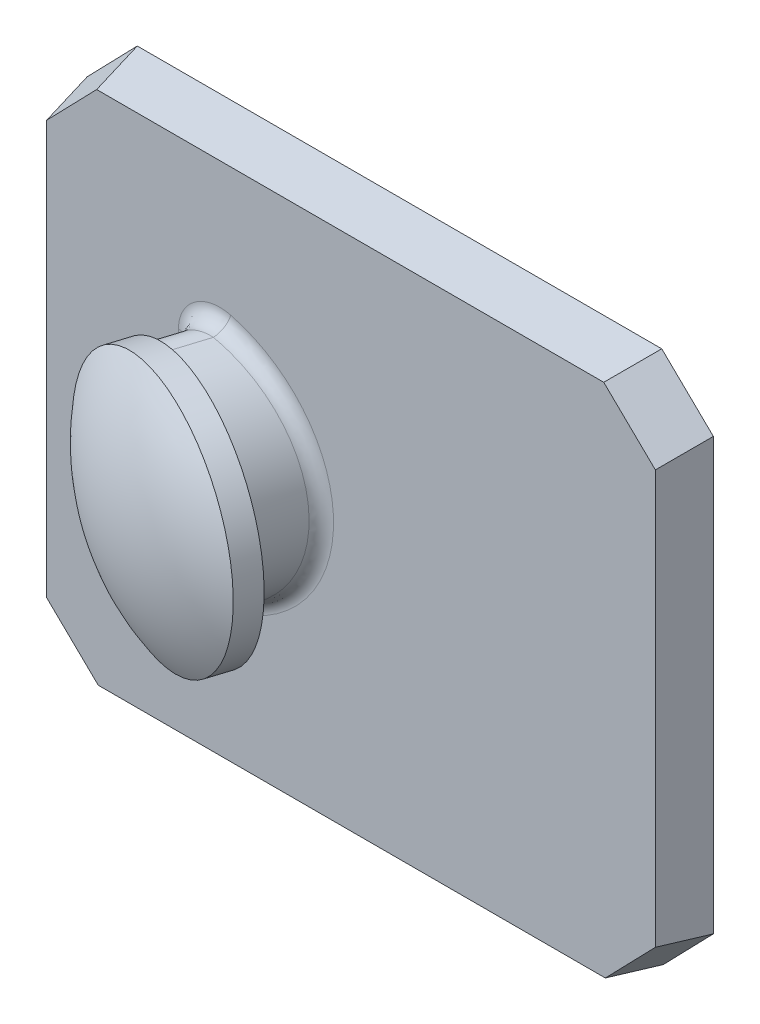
from build123d import *
from OCP.BRepFilletAPI import BRepFilletAPI_MakeChamfer

# Parameters (mm, degrees)
SKETCH1_W      = 12.699
SKETCH1_H      = 10.8
EXTRUDE1_DEPTH = 1
EXTRUDE1_TAPER = 10
EXTRUDE2_REACH = 105.423
FILLET2_R      = 0.3
CHAMFER1_SIZE  = 1
CHAMFER1_SIZE2 = 1.031574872


with BuildPart() as part:
    # Sketch1 → Extrude1 (new body)
    with BuildSketch(Plane.XY):
        with Locations((101.5505, 0)):
            Rectangle(SKETCH1_W, SKETCH1_H)
    extrude(amount=EXTRUDE1_DEPTH, taper=EXTRUDE1_TAPER)

    # Extrude2: up to this plane
    extrude2_end = Plane(origin=(95.201, -5.4, 1), z_dir=(0, 0, -1))
    # Sketch2 → Extrude2 (add, up to the surface)
    with BuildSketch(Plane(origin=(8.326251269, 0, -26.426922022), x_dir=(0.9537803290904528, 0, 0.30050471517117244), z_dir=(-0.30050471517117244, 0, 0.9537803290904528)), mode=Mode.PRIVATE) as extrude2_sk1:
        with BuildLine():
            Line((94.210058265, 1.848172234), (94.210058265, -1.81788696))
            ThreePointArc((94.210058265, -1.81788696), (94.406569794, -2.215246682), (94.841637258, -2.300263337))
            ThreePointArc((94.841637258, -2.300263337), (96.610057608, 0.015142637), (94.841637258, 2.330548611))
            ThreePointArc((94.841637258, 2.330548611), (94.406569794, 2.245531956), (94.210058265, 1.848172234))
        make_face()
    extrude2_tool1 = split(extrude(extrude2_sk1.sketch, amount=-EXTRUDE2_REACH, mode=Mode.PRIVATE), bisect_by=extrude2_end, keep=Keep.BOTH, mode=Mode.PRIVATE)
    add(extrude2_tool1.solids().sort_by_distance((99.168287, 0.015143, 2.194406))[0])

    # Sketch3 → Revolve2 (revolve)
    with BuildSketch(Plane(origin=(0, 0, 0), x_dir=(1, 0, 0), z_dir=(0, 1, 0)), mode=Mode.PRIVATE) as revolve2_sk:
        with BuildLine():
            Line((99.31173721, -2.157209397), (101.697584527, -2.908912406))
            Line((101.697584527, -2.908912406), (101.547430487, -3.385489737))
            ThreePointArc((101.547430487, -3.385489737), (100.238921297, -3.560859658), (98.935380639, -3.351736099))
            Line((98.935380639, -3.351736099), (99.31173721, -2.157209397))
        make_face()
    revolve(revolve2_sk.sketch.rotate(Axis((99.588355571, 0, 1.279244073), (-0.30050516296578, 0, 0.9537801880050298)), 180), axis=Axis((99.588355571, 0, 1.279244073), (-0.30050516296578, 0, 0.9537801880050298)))

    # Fillet2
    fillet2_edges = [part.edges().sort_by_distance(p)[0] for p in [
        (98.672376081, 2.249826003, 1),
        (98.460358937, 0.015142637, 1),
        (98.672376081, -2.219540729, 1),
        (100.976660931, 0.015142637, 1),
    ]]
    fillet(fillet2_edges, radius=FILLET2_R)

    # Chamfer1: one chamfer whose edges measure the first distance from different faces: ONE call of the kernel's chamfer builder (chamfer() names one face for all edges)
    chamfer1_edges_1 = [part.edges().sort_by_distance(p)[0] for p in [
        (95.289163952, 5.311836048, 0.50000262),
    ]]
    chamfer1_side_1 = [part.faces().sort_by_distance(p)[0] for p in [
        (101.5505, 5.312250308, 0.49765323),
    ]]
    chamfer1_edges_2 = [part.edges().sort_by_distance(p)[0] for p in [
        (107.811836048, 5.311836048, 0.50000262),
    ]]
    chamfer1_side_2 = [part.faces().sort_by_distance(p)[0] for p in [
        (107.812324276, 0, 0.497233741),
    ]]
    chamfer1_edges_3 = [part.edges().sort_by_distance(p)[0] for p in [
        (107.81183651, -5.31183651, 0.5),
    ]]
    chamfer1_side_3 = [part.faces().sort_by_distance(p)[0] for p in [
        (101.5505, -5.312250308, 0.49765323),
    ]]
    chamfer1_edges_4 = [part.edges().sort_by_distance(p)[0] for p in [
        (95.28916349, -5.31183651, 0.5),
    ]]
    chamfer1_side_4 = [part.faces().sort_by_distance(p)[0] for p in [
        (95.288675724, 0, 0.497233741),
    ]]
    chamfer1 = BRepFilletAPI_MakeChamfer(part.part.solid().wrapped)
    for e in chamfer1_edges_1:
        chamfer1.Add(CHAMFER1_SIZE, CHAMFER1_SIZE2, e.wrapped, chamfer1_side_1[0].wrapped)  # the first distance lies on this face
    for e in chamfer1_edges_2:
        chamfer1.Add(CHAMFER1_SIZE, CHAMFER1_SIZE2, e.wrapped, chamfer1_side_2[0].wrapped)  # the first distance lies on this face
    for e in chamfer1_edges_3:
        chamfer1.Add(CHAMFER1_SIZE, CHAMFER1_SIZE2, e.wrapped, chamfer1_side_3[0].wrapped)  # the first distance lies on this face
    for e in chamfer1_edges_4:
        chamfer1.Add(CHAMFER1_SIZE, CHAMFER1_SIZE2, e.wrapped, chamfer1_side_4[0].wrapped)  # the first distance lies on this face
    add(Compound.cast(chamfer1.Shape()), mode=Mode.REPLACE)


solid = part.part
